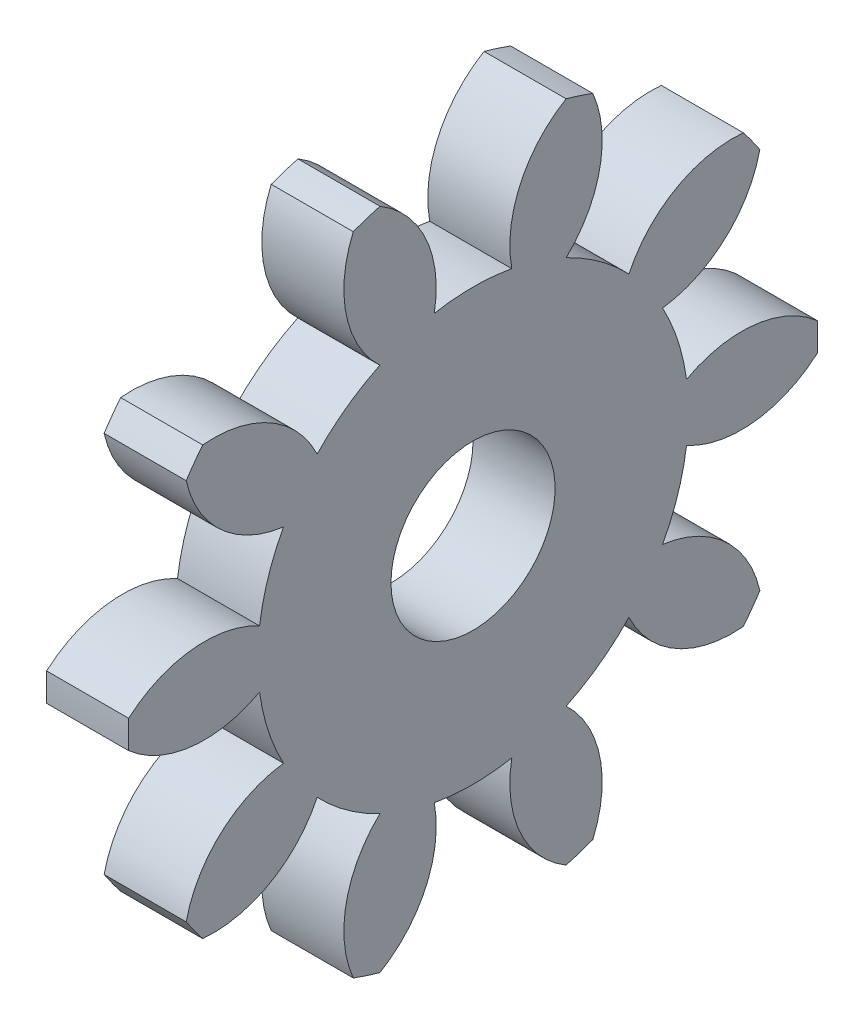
from build123d import *

# Parameters (mm, degrees)
BASPROSKE_W     = 5
BASPROSKE_H     = 21
TOOTHCUT_DEPTH  = 31.116440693
TEETHCUTS_COUNT = 10
TEETHCUTS_ANGLE = 324
BORSKE_R        = 5
BORE_DEPTH      = 50.0000508


with BuildPart() as part:
    # BasProSke → Base-Revolve (revolve)
    with BuildSketch(Plane(origin=(0, 0, 0), x_dir=(1, 0, 0), z_dir=(0, 1, 0)), mode=Mode.PRIVATE) as base_revolve_sk:
        with Locations((2.5, 10.5)):
            Rectangle(BASPROSKE_W, BASPROSKE_H)
    revolve(base_revolve_sk.sketch.rotate(Axis((-10, 0, 0), (1, 0, 0)), 180), axis=Axis((-10, 0, 0), (1, 0, 0)))

    # TooCutSke → ToothCut (cut, through all)
    with BuildSketch(Plane(origin=(0, 0, 0), x_dir=(0, 0, -1), z_dir=(1, 0, 0))):
        with BuildLine():
            ThreePointArc((2.361958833, 12.909706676), (0, 13.124), (-2.361958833, 12.909706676))
            ThreePointArc((-2.361958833, 12.909706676), (-2.871960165, 17.101934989), (-5.700525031, 20.237871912))
            ThreePointArc((-5.700525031, 20.237871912), (0, 21.0254), (5.700525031, 20.237871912))
            ThreePointArc((5.700525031, 20.237871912), (2.871960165, 17.101934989), (2.361958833, 12.909706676))
        make_face()
    toothcut = extrude(amount=TOOTHCUT_DEPTH, mode=Mode.SUBTRACT)

    # TeethCuts: ToothCut ×10 about axis
    teethcuts_axis = Axis((-10, 0, 0), (1, 0, 0))
    for i in range(1, TEETHCUTS_COUNT):
        add(toothcut.rotate(teethcuts_axis, i * TEETHCUTS_ANGLE / (TEETHCUTS_COUNT - 1)), mode=Mode.SUBTRACT)

    # BorSke → Bore (cut, symmetric)
    with BuildSketch(Plane(origin=(0, 0, 0), x_dir=(0, 0, -1), z_dir=(1, 0, 0))):
        with Locations(Location((0, 0, 0), (0, 0, 180))):
            Circle(BORSKE_R)
    extrude(amount=BORE_DEPTH, both=True, mode=Mode.SUBTRACT)


solid = part.part
